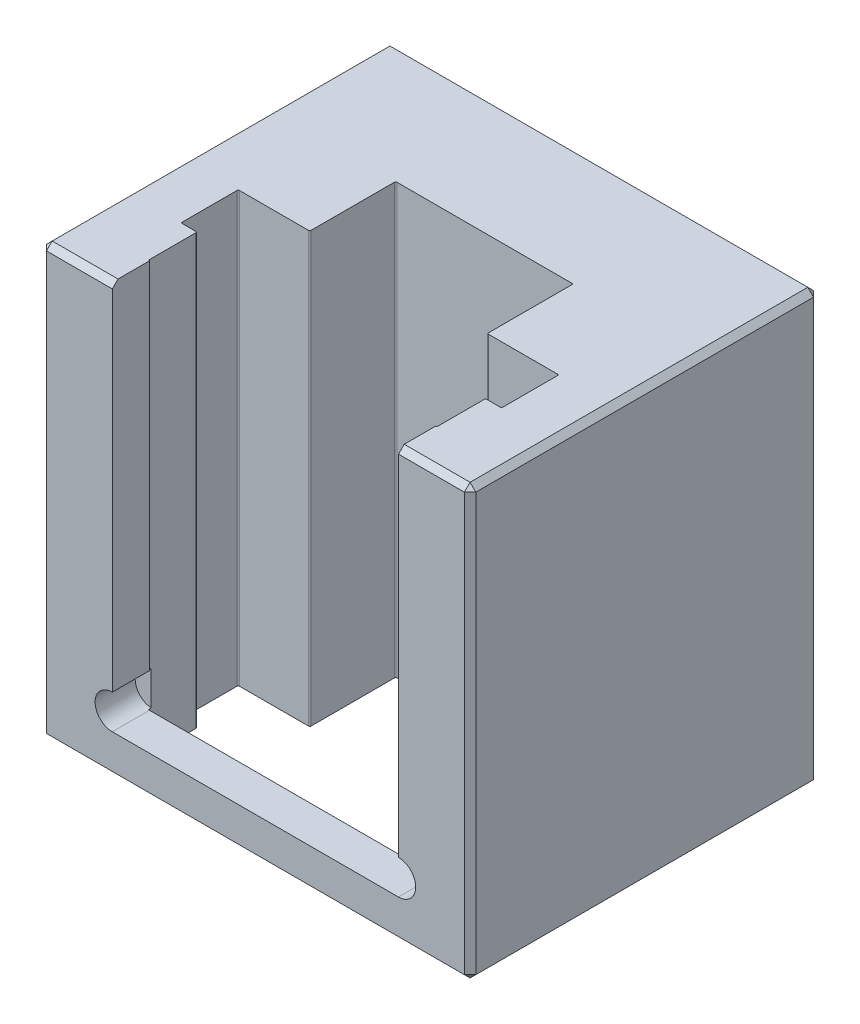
from build123d import *

# Parameters (mm, degrees)
ESQUISSE1_W                              = 75
ESQUISSE1_H                              = 75
BLOC_DE_BASE_75_X75_EP_61_DEPTH          = 61
CASSAGES_D_ANGLES_BLOC_SIZE              = 1
OUVERTURE_PASSAGE_CASSETTE_DEPTH         = 104.693056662
OUVERTURE_POSITIONNEMENT_EMPREINTE_REACH = 82.83
ESQUISSE3_W                              = 50
ESQUISSE3_H                              = 68
CASSAGES_D_ANGLES_CASSETTE_R             = 0.2
ESQUISSE4_R                              = 3
D_GAGEMENTS_POUR_BUT_E_CASSETTE_DEPTH    = 7
ESQUISSE5_R                              = 5
PASSAGE_TIGE_D_JECTION_DEPTH             = 81.830068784
ESQUISSE10_R                             = 7
ENL_V_MAT_EXTRU_1_DEPTH                  = 5.2
CHANFREIN1_SIZE                          = 0.5
CHANFREIN2_SIZE                          = 0.5
R_P_TITION_LIN_AIRE1_COUNT               = 2
R_P_TITION_LIN_AIRE1_PITCH               = 63
R_P_TITION_LIN_AIRE1_COUNT_DIR2          = 2
R_P_TITION_LIN_AIRE1_PITCH_DIR2          = 63


with BuildPart() as part:
    # Esquisse1 → Bloc de base 75 x75 ep 61 (new body)
    with BuildSketch(Plane.XY):
        Rectangle(ESQUISSE1_W, ESQUISSE1_H)
    extrude(amount=BLOC_DE_BASE_75_X75_EP_61_DEPTH)

    # Cassages d_angles bloc
    cassages_d_angles_bloc_edges = [part.edges().sort_by_distance(p)[0] for p in [
        (37.5, 0, 61),
        (0, 37.5, 61),
        (-37.5, 0, 61),
        (0, 37.5, 0),
        (37.5, 0, 0),
        (0, -37.5, 0),
        (-37.5, 0, 0),
        (0, -37.5, 61),
        (-37.5, 37.5, 30.5),
        (37.5, 37.5, 30.5),
        (37.5, -37.5, 30.5),
        (-37.5, -37.5, 30.5),
    ]]
    chamfer(cassages_d_angles_bloc_edges, length=CASSAGES_D_ANGLES_BLOC_SIZE)

    # Esquisse2 → Ouverture passage cassette (cut, through all)
    with BuildSketch(Plane(origin=(0, 37.5, 0), x_dir=(1, 0, 0), z_dir=(0, 1, 0))):
        Polygon((-28, -46), (-25.2, -46), (-25.2, -54.5), (25.2, -54.5), (25.2, -46), (28, -46), (28, -36), (15.5, -36), (15.5, -21), (-15.5, -21), (-15.5, -36), (-28, -36), align=None)
    extrude(amount=-OUVERTURE_PASSAGE_CASSETTE_DEPTH, mode=Mode.SUBTRACT)

    # Ouverture positionnement empreinte: up to this face of the body (flat: up to its plane)
    ouverture_positionnement_empreinte_end = Plane(part.part.faces().sort_by_distance((0, 0, 54.5))[0])
    # Esquisse3 → Ouverture positionnement empreinte (cut, up to the picked face)
    with BuildSketch(Plane.XY.offset(61), mode=Mode.PRIVATE) as ouverture_positionnement_empreinte_sk1:
        with Locations((0, 3.5)):
            Rectangle(ESQUISSE3_W, ESQUISSE3_H)
    ouverture_positionnement_empreinte_tool1 = split(extrude(ouverture_positionnement_empreinte_sk1.sketch, amount=-OUVERTURE_POSITIONNEMENT_EMPREINTE_REACH, mode=Mode.PRIVATE), bisect_by=ouverture_positionnement_empreinte_end, keep=Keep.BOTH, mode=Mode.PRIVATE)
    add(ouverture_positionnement_empreinte_tool1.solids().sort_by(Axis((0, 3.5, 61), (0, 0, -1)))[0], mode=Mode.SUBTRACT)

    # cassages d_angles cassette
    cassages_d_angles_cassette_edges = [part.edges().sort_by_distance(p)[0] for p in [
        (25.2, 0, 46),
        (28, 0, 46),
        (28, 0, 36),
        (15.5, 0, 36),
        (15.5, 0, 21),
        (-15.5, 0, 21),
        (-15.5, 0, 36),
        (-28, 0, 36),
        (-28, 0, 46),
        (-25.2, 0, 46),
        (25.2, 0, 54.5),
        (-25.2, 0, 54.5),
    ]]
    fillet(cassages_d_angles_cassette_edges, radius=CASSAGES_D_ANGLES_CASSETTE_R)

    # Esquisse4 → D_gagements pour but_e cassette (cut)
    with BuildSketch(Plane.XY.offset(61)):
        with Locations((-25, -27.5)):
            Circle(ESQUISSE4_R)
        with Locations((25, -27.5)):
            Circle(ESQUISSE4_R)
    extrude(amount=-D_GAGEMENTS_POUR_BUT_E_CASSETTE_DEPTH, mode=Mode.SUBTRACT)

    # Esquisse5 → passage tige d_jection (cut, through all)
    with BuildSketch(Plane(origin=(0, 0, 0), x_dir=(-1, 0, 0), z_dir=(0, 0, -1))):
        Circle(ESQUISSE5_R)
    extrude(amount=-PASSAGE_TIGE_D_JECTION_DEPTH, mode=Mode.SUBTRACT)

    # Esquisse10 → Enl_v. mat.-Extru.1 (cut)
    with BuildSketch(Plane.XY.offset(21)):
        Circle(ESQUISSE10_R)
    extrude(amount=-ENL_V_MAT_EXTRU_1_DEPTH, mode=Mode.SUBTRACT)

    # Chanfrein1
    chanfrein1_edges = [part.edges().sort_by_distance(p)[0] for p in [
        (-7, 0, 21),
    ]]
    chamfer(chanfrein1_edges, length=CHANFREIN1_SIZE)

    # Chanfrein2
    chanfrein2_edges = [part.edges().sort_by_distance(p)[0] for p in [
        (5, 0, 15.8),
    ]]
    chamfer(chanfrein2_edges, length=CHANFREIN2_SIZE)

    # Esquisse8 → Trous taraud_s M6 de fixation (revolve, cut)
    with BuildSketch(Plane(origin=(31.5, 31.5, 0), x_dir=(0, 1, 0), z_dir=(1, 0, 0))):
        Polygon((0, 0), (0, 31.502151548), (2.5, 30), (2.5, 1), (3.5, 0), align=None)
    trous_taraud_s_m6_de_fixation = revolve(axis=Axis((31.5, 31.5, -6.35), (0, 0, 1)), mode=Mode.SUBTRACT)

    # R_p_tition lin_aire1: Trous taraud_s M6 de fixation 2 × 2
    with Locations(*[(-i * R_P_TITION_LIN_AIRE1_PITCH, -j * R_P_TITION_LIN_AIRE1_PITCH_DIR2, 0) for i in range(R_P_TITION_LIN_AIRE1_COUNT) for j in range(R_P_TITION_LIN_AIRE1_COUNT_DIR2) if (i, j) != (0, 0)]):
        add(trous_taraud_s_m6_de_fixation, mode=Mode.SUBTRACT)


solid = part.part
